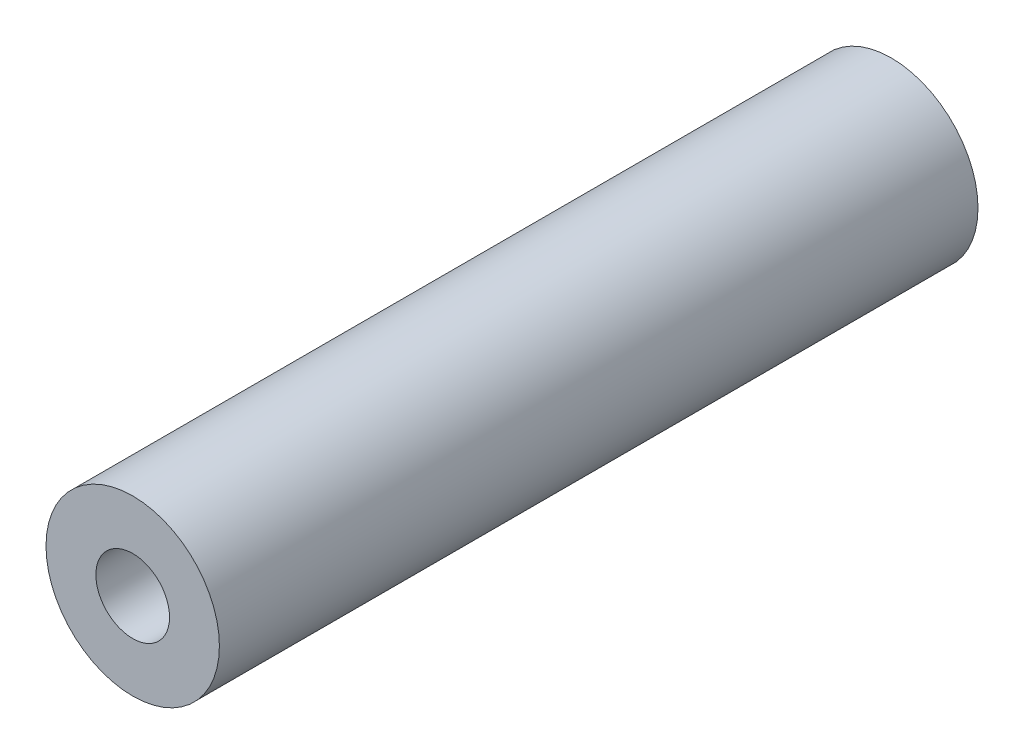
ISO-10303-21;
HEADER;
FILE_DESCRIPTION(('STEP AP214'),'2;1');
FILE_NAME('part.step','',(''),(''),'','','');
FILE_SCHEMA(('AUTOMOTIVE_DESIGN { 1 0 10303 214 1 1 1 1 }'));
ENDSEC;
DATA;
#1=APPLICATION_CONTEXT('core data for automotive mechanical design processes');
#2=APPLICATION_PROTOCOL_DEFINITION('international standard','automotive_design',2000,#1);
#3=PRODUCT_CONTEXT('',#1,'mechanical');
#4=PRODUCT('Part','Part','',(#3));
#5=PRODUCT_RELATED_PRODUCT_CATEGORY('part','',(#4));
#6=PRODUCT_DEFINITION_FORMATION('','',#4);
#7=PRODUCT_DEFINITION_CONTEXT('part definition',#1,'design');
#8=PRODUCT_DEFINITION('design','',#6,#7);
#9=PRODUCT_DEFINITION_SHAPE('','',#8);
#10=(LENGTH_UNIT() NAMED_UNIT(*) SI_UNIT(.MILLI.,.METRE.));
#11=(NAMED_UNIT(*) PLANE_ANGLE_UNIT() SI_UNIT($,.RADIAN.));
#12=(NAMED_UNIT(*) SI_UNIT($,.STERADIAN.) SOLID_ANGLE_UNIT());
#13=UNCERTAINTY_MEASURE_WITH_UNIT(LENGTH_MEASURE(1.E-05),#10,'distance_accuracy_value','');
#14=(GEOMETRIC_REPRESENTATION_CONTEXT(3) GLOBAL_UNCERTAINTY_ASSIGNED_CONTEXT((#13)) GLOBAL_UNIT_ASSIGNED_CONTEXT((#10,
#11,#12)) REPRESENTATION_CONTEXT('',''));
#15=CARTESIAN_POINT('',(0.,0.,0.));
#16=DIRECTION('',(0.,0.,1.));
#17=DIRECTION('',(1.,0.,0.));
#18=AXIS2_PLACEMENT_3D('',#15,#16,#17);
#19=CARTESIAN_POINT('',(0.,0.,35.));
#20=DIRECTION('',(0.,0.,1.));
#21=DIRECTION('',(1.,0.,0.));
#22=AXIS2_PLACEMENT_3D('',#19,#20,#21);
#23=PLANE('',#22);
#24=CARTESIAN_POINT('',(0.,0.,35.));
#25=DIRECTION('',(0.,0.,1.));
#26=DIRECTION('',(1.,0.,0.));
#27=AXIS2_PLACEMENT_3D('',#24,#25,#26);
#28=CIRCLE('',#27,4.);
#29=CARTESIAN_POINT('',(4.,0.,35.));
#30=VERTEX_POINT('',#29);
#31=EDGE_CURVE('E10',#30,#30,#28,.T.);
#32=ORIENTED_EDGE('',*,*,#31,.T.);
#33=EDGE_LOOP('',(#32));
#34=FACE_BOUND('',#33,.T.);
#35=CARTESIAN_POINT('',(0.,0.,35.));
#36=DIRECTION('',(0.,0.,1.));
#37=DIRECTION('',(1.,0.,0.));
#38=AXIS2_PLACEMENT_3D('',#35,#36,#37);
#39=CIRCLE('',#38,1.7);
#40=CARTESIAN_POINT('',(1.7,0.,35.));
#41=VERTEX_POINT('',#40);
#42=EDGE_CURVE('E52',#41,#41,#39,.T.);
#43=ORIENTED_EDGE('',*,*,#42,.F.);
#44=EDGE_LOOP('',(#43));
#45=FACE_BOUND('',#44,.T.);
#46=ADVANCED_FACE('F41',(#34,#45),#23,.T.);
#47=CARTESIAN_POINT('',(0.,0.,0.));
#48=DIRECTION('',(0.,0.,1.));
#49=DIRECTION('',(1.,0.,0.));
#50=AXIS2_PLACEMENT_3D('',#47,#48,#49);
#51=PLANE('',#50);
#52=CARTESIAN_POINT('',(0.,0.,0.));
#53=DIRECTION('',(0.,0.,1.));
#54=DIRECTION('',(1.,0.,0.));
#55=AXIS2_PLACEMENT_3D('',#52,#53,#54);
#56=CIRCLE('',#55,4.);
#57=CARTESIAN_POINT('',(4.,0.,0.));
#58=VERTEX_POINT('',#57);
#59=EDGE_CURVE('E45',#58,#58,#56,.T.);
#60=ORIENTED_EDGE('',*,*,#59,.F.);
#61=EDGE_LOOP('',(#60));
#62=FACE_BOUND('',#61,.T.);
#63=CARTESIAN_POINT('',(0.,0.,0.));
#64=DIRECTION('',(0.,0.,1.));
#65=DIRECTION('',(1.,0.,0.));
#66=AXIS2_PLACEMENT_3D('',#63,#64,#65);
#67=CIRCLE('',#66,1.7);
#68=CARTESIAN_POINT('',(1.7,0.,0.));
#69=VERTEX_POINT('',#68);
#70=EDGE_CURVE('E54',#69,#69,#67,.T.);
#71=ORIENTED_EDGE('',*,*,#70,.T.);
#72=EDGE_LOOP('',(#71));
#73=FACE_BOUND('',#72,.T.);
#74=ADVANCED_FACE('F64',(#62,#73),#51,.F.);
#75=CARTESIAN_POINT('',(0.,0.,35.));
#76=DIRECTION('',(0.,0.,-1.));
#77=DIRECTION('',(-1.,0.,0.));
#78=AXIS2_PLACEMENT_3D('',#75,#76,#77);
#79=CYLINDRICAL_SURFACE('',#78,4.);
#80=ORIENTED_EDGE('',*,*,#31,.F.);
#81=EDGE_LOOP('',(#80));
#82=FACE_BOUND('',#81,.T.);
#83=ORIENTED_EDGE('',*,*,#59,.T.);
#84=EDGE_LOOP('',(#83));
#85=FACE_BOUND('',#84,.T.);
#86=ADVANCED_FACE('F43',(#82,#85),#79,.T.);
#87=CARTESIAN_POINT('',(0.,0.,35.));
#88=DIRECTION('',(0.,0.,-1.));
#89=DIRECTION('',(-1.,0.,0.));
#90=AXIS2_PLACEMENT_3D('',#87,#88,#89);
#91=CYLINDRICAL_SURFACE('',#90,1.7);
#92=ORIENTED_EDGE('',*,*,#42,.T.);
#93=EDGE_LOOP('',(#92));
#94=FACE_BOUND('',#93,.T.);
#95=ORIENTED_EDGE('',*,*,#70,.F.);
#96=EDGE_LOOP('',(#95));
#97=FACE_BOUND('',#96,.T.);
#98=ADVANCED_FACE('F60',(#94,#97),#91,.F.);
#99=CLOSED_SHELL('',(#46,#74,#86,#98));
#100=MANIFOLD_SOLID_BREP('B2',#99);
#101=ADVANCED_BREP_SHAPE_REPRESENTATION('',(#18,#100),#14);
#102=SHAPE_DEFINITION_REPRESENTATION(#9,#101);
ENDSEC;
END-ISO-10303-21;
